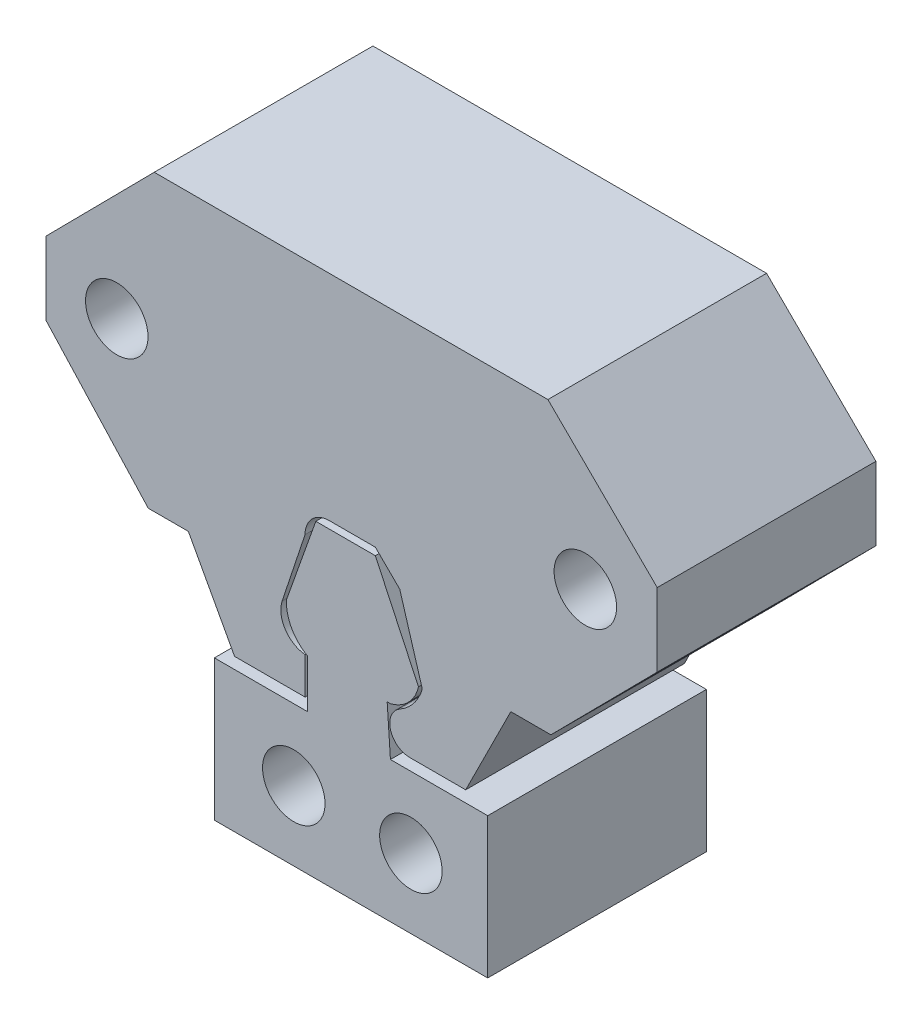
ISO-10303-21;
HEADER;
FILE_DESCRIPTION(('STEP AP214'),'2;1');
FILE_NAME('part.step','',(''),(''),'','','');
FILE_SCHEMA(('AUTOMOTIVE_DESIGN { 1 0 10303 214 1 1 1 1 }'));
ENDSEC;
DATA;
#1=APPLICATION_CONTEXT('core data for automotive mechanical design processes');
#2=APPLICATION_PROTOCOL_DEFINITION('international standard','automotive_design',2000,#1);
#3=PRODUCT_CONTEXT('',#1,'mechanical');
#4=PRODUCT('Part','Part','',(#3));
#5=PRODUCT_RELATED_PRODUCT_CATEGORY('part','',(#4));
#6=PRODUCT_DEFINITION_FORMATION('','',#4);
#7=PRODUCT_DEFINITION_CONTEXT('part definition',#1,'design');
#8=PRODUCT_DEFINITION('design','',#6,#7);
#9=PRODUCT_DEFINITION_SHAPE('','',#8);
#10=(LENGTH_UNIT() NAMED_UNIT(*) SI_UNIT(.MILLI.,.METRE.));
#11=(NAMED_UNIT(*) PLANE_ANGLE_UNIT() SI_UNIT($,.RADIAN.));
#12=(NAMED_UNIT(*) SI_UNIT($,.STERADIAN.) SOLID_ANGLE_UNIT());
#13=UNCERTAINTY_MEASURE_WITH_UNIT(LENGTH_MEASURE(1.E-05),#10,'distance_accuracy_value','');
#14=(GEOMETRIC_REPRESENTATION_CONTEXT(3) GLOBAL_UNCERTAINTY_ASSIGNED_CONTEXT((#13)) GLOBAL_UNIT_ASSIGNED_CONTEXT((#10,
#11,#12)) REPRESENTATION_CONTEXT('',''));
#15=CARTESIAN_POINT('',(0.,0.,0.));
#16=DIRECTION('',(0.,0.,1.));
#17=DIRECTION('',(1.,0.,0.));
#18=AXIS2_PLACEMENT_3D('',#15,#16,#17);
#19=CARTESIAN_POINT('',(155.962614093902,172.348565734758,28.));
#20=DIRECTION('',(0.,0.,1.));
#21=DIRECTION('',(1.,0.,0.));
#22=AXIS2_PLACEMENT_3D('',#19,#20,#21);
#23=PLANE('',#22);
#24=CARTESIAN_POINT('',(131.539430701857,194.135131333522,28.));
#25=DIRECTION('',(0.,0.,1.));
#26=DIRECTION('',(1.,0.,0.));
#27=AXIS2_PLACEMENT_3D('',#24,#25,#26);
#28=CIRCLE('',#27,3.99999999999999);
#29=CARTESIAN_POINT('',(135.539430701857,194.135131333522,28.));
#30=VERTEX_POINT('',#29);
#31=EDGE_CURVE('E250',#30,#30,#28,.T.);
#32=ORIENTED_EDGE('',*,*,#31,.F.);
#33=EDGE_LOOP('',(#32));
#34=FACE_BOUND('',#33,.T.);
#35=DIRECTION('',(1.,0.,0.));
#36=VECTOR('',#35,1.);
#37=CARTESIAN_POINT('',(154.202749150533,164.233861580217,28.));
#38=LINE('',#37,#36);
#39=CARTESIAN_POINT('',(146.627618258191,164.233861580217,28.));
#40=VERTEX_POINT('',#39);
#41=CARTESIAN_POINT('',(155.666645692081,164.233861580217,28.));
#42=VERTEX_POINT('',#41);
#43=EDGE_CURVE('E314',#40,#42,#38,.T.);
#44=ORIENTED_EDGE('',*,*,#43,.T.);
#45=DIRECTION('',(0.,1.,0.));
#46=VECTOR('',#45,1.);
#47=CARTESIAN_POINT('',(155.666645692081,168.944632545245,28.));
#48=LINE('',#47,#46);
#49=CARTESIAN_POINT('',(155.666645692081,168.944632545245,28.));
#50=VERTEX_POINT('',#49);
#51=EDGE_CURVE('E144',#42,#50,#48,.T.);
#52=ORIENTED_EDGE('',*,*,#51,.T.);
#53=CARTESIAN_POINT('',(155.962614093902,172.348565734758,28.));
#54=DIRECTION('',(0.,0.,-1.));
#55=DIRECTION('',(1.,0.,0.));
#56=AXIS2_PLACEMENT_3D('',#53,#54,#55);
#57=CIRCLE('',#56,3.41677603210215);
#58=CARTESIAN_POINT('',(152.719930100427,173.425301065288,28.));
#59=VERTEX_POINT('',#58);
#60=EDGE_CURVE('E309',#50,#59,#57,.T.);
#61=ORIENTED_EDGE('',*,*,#60,.T.);
#62=DIRECTION('',(0.315131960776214,0.949047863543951,0.));
#63=VECTOR('',#62,1.);
#64=CARTESIAN_POINT('',(155.651170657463,182.252992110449,28.));
#65=LINE('',#64,#63);
#66=CARTESIAN_POINT('',(155.651170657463,182.252992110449,28.));
#67=VERTEX_POINT('',#66);
#68=EDGE_CURVE('E232',#59,#67,#65,.T.);
#69=ORIENTED_EDGE('',*,*,#68,.T.);
#70=CARTESIAN_POINT('',(158.754258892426,182.252016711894,28.));
#71=DIRECTION('',(0.,0.,-1.));
#72=DIRECTION('',(1.,0.,0.));
#73=AXIS2_PLACEMENT_3D('',#70,#71,#72);
#74=CIRCLE('',#73,3.1030883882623);
#75=CARTESIAN_POINT('',(158.754258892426,185.355105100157,28.));
#76=VERTEX_POINT('',#75);
#77=EDGE_CURVE('E304',#67,#76,#74,.T.);
#78=ORIENTED_EDGE('',*,*,#77,.T.);
#79=DIRECTION('',(1.,0.,0.));
#80=VECTOR('',#79,1.);
#81=CARTESIAN_POINT('',(164.653484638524,185.355105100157,28.));
#82=LINE('',#81,#80);
#83=CARTESIAN_POINT('',(164.653484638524,185.355105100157,28.));
#84=VERTEX_POINT('',#83);
#85=EDGE_CURVE('E301',#76,#84,#82,.T.);
#86=ORIENTED_EDGE('',*,*,#85,.T.);
#87=DIRECTION('',(0.710916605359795,-0.703276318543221,0.));
#88=VECTOR('',#87,1.);
#89=CARTESIAN_POINT('',(167.771821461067,182.270281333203,28.));
#90=LINE('',#89,#88);
#91=CARTESIAN_POINT('',(167.771821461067,182.270281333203,28.));
#92=VERTEX_POINT('',#91);
#93=EDGE_CURVE('E298',#84,#92,#90,.T.);
#94=ORIENTED_EDGE('',*,*,#93,.T.);
#95=DIRECTION('',(0.287145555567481,-0.957886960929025,0.));
#96=VECTOR('',#95,1.);
#97=CARTESIAN_POINT('',(170.663369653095,172.624384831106,28.));
#98=LINE('',#97,#96);
#99=CARTESIAN_POINT('',(170.663369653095,172.624384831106,28.));
#100=VERTEX_POINT('',#99);
#101=EDGE_CURVE('E295',#92,#100,#98,.T.);
#102=ORIENTED_EDGE('',*,*,#101,.T.);
#103=CARTESIAN_POINT('',(164.670683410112,174.385026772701,28.));
#104=DIRECTION('',(0.,0.,-1.));
#105=DIRECTION('',(1.,0.,0.));
#106=AXIS2_PLACEMENT_3D('',#103,#104,#105);
#107=CIRCLE('',#106,6.24597057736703);
#108=CARTESIAN_POINT('',(167.771821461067,168.963302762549,28.));
#109=VERTEX_POINT('',#108);
#110=EDGE_CURVE('E292',#100,#109,#107,.T.);
#111=ORIENTED_EDGE('',*,*,#110,.T.);
#112=CARTESIAN_POINT('',(169.028852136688,166.765634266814,28.));
#113=DIRECTION('',(0.,0.,1.));
#114=DIRECTION('',(-1.,0.,0.));
#115=AXIS2_PLACEMENT_3D('',#112,#113,#114);
#116=CIRCLE('',#115,2.53177268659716);
#117=CARTESIAN_POINT('',(169.028852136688,164.233861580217,28.));
#118=VERTEX_POINT('',#117);
#119=EDGE_CURVE('E289',#109,#118,#116,.T.);
#120=ORIENTED_EDGE('',*,*,#119,.T.);
#121=DIRECTION('',(1.,0.,0.));
#122=VECTOR('',#121,1.);
#123=CARTESIAN_POINT('',(176.220729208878,164.233861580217,28.));
#124=LINE('',#123,#122);
#125=CARTESIAN_POINT('',(176.220729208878,164.233861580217,28.));
#126=VERTEX_POINT('',#125);
#127=EDGE_CURVE('E286',#118,#126,#124,.T.);
#128=ORIENTED_EDGE('',*,*,#127,.T.);
#129=DIRECTION('',(0.447037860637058,0.894515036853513,0.));
#130=VECTOR('',#129,1.);
#131=CARTESIAN_POINT('',(181.996754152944,175.791587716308,28.));
#132=LINE('',#131,#130);
#133=CARTESIAN_POINT('',(181.996754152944,175.791587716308,28.));
#134=VERTEX_POINT('',#133);
#135=EDGE_CURVE('E283',#126,#134,#132,.T.);
#136=ORIENTED_EDGE('',*,*,#135,.T.);
#137=DIRECTION('',(1.,0.,0.));
#138=VECTOR('',#137,1.);
#139=CARTESIAN_POINT('',(187.130080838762,175.791587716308,28.));
#140=LINE('',#139,#138);
#141=CARTESIAN_POINT('',(187.130080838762,175.791587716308,28.));
#142=VERTEX_POINT('',#141);
#143=EDGE_CURVE('E280',#134,#142,#140,.T.);
#144=ORIENTED_EDGE('',*,*,#143,.T.);
#145=DIRECTION('',(0.703276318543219,0.710916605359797,0.));
#146=VECTOR('',#145,1.);
#147=CARTESIAN_POINT('',(200.746457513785,189.555890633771,28.));
#148=LINE('',#147,#146);
#149=CARTESIAN_POINT('',(200.746457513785,189.555890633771,28.));
#150=VERTEX_POINT('',#149);
#151=EDGE_CURVE('E277',#142,#150,#148,.T.);
#152=ORIENTED_EDGE('',*,*,#151,.T.);
#153=DIRECTION('',(0.,1.,0.));
#154=VECTOR('',#153,1.);
#155=CARTESIAN_POINT('',(200.746457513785,198.927124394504,28.));
#156=LINE('',#155,#154);
#157=CARTESIAN_POINT('',(200.746457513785,198.927124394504,28.));
#158=VERTEX_POINT('',#157);
#159=EDGE_CURVE('E274',#150,#158,#156,.T.);
#160=ORIENTED_EDGE('',*,*,#159,.T.);
#161=DIRECTION('',(-0.710916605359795,0.70327631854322,0.));
#162=VECTOR('',#161,1.);
#163=CARTESIAN_POINT('',(186.746457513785,212.776665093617,28.));
#164=LINE('',#163,#162);
#165=CARTESIAN_POINT('',(186.746457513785,212.776665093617,28.));
#166=VERTEX_POINT('',#165);
#167=EDGE_CURVE('E271',#158,#166,#164,.T.);
#168=ORIENTED_EDGE('',*,*,#167,.T.);
#169=DIRECTION('',(-1.,0.,0.));
#170=VECTOR('',#169,1.);
#171=CARTESIAN_POINT('',(136.340150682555,212.776665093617,28.));
#172=LINE('',#171,#170);
#173=CARTESIAN_POINT('',(136.340150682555,212.776665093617,28.));
#174=VERTEX_POINT('',#173);
#175=EDGE_CURVE('E268',#166,#174,#172,.T.);
#176=ORIENTED_EDGE('',*,*,#175,.T.);
#177=DIRECTION('',(-0.703276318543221,-0.710916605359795,0.));
#178=VECTOR('',#177,1.);
#179=CARTESIAN_POINT('',(136.340150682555,212.776665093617,28.));
#180=LINE('',#179,#178);
#181=CARTESIAN_POINT('',(122.490609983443,198.776665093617,28.));
#182=VERTEX_POINT('',#181);
#183=EDGE_CURVE('E265',#174,#182,#180,.T.);
#184=ORIENTED_EDGE('',*,*,#183,.T.);
#185=DIRECTION('',(0.,-1.,0.));
#186=VECTOR('',#185,1.);
#187=CARTESIAN_POINT('',(122.490609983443,198.776665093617,28.));
#188=LINE('',#187,#186);
#189=CARTESIAN_POINT('',(122.490609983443,189.405431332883,28.));
#190=VERTEX_POINT('',#189);
#191=EDGE_CURVE('E262',#182,#190,#188,.T.);
#192=ORIENTED_EDGE('',*,*,#191,.T.);
#193=DIRECTION('',(0.675837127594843,-0.73705100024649,0.));
#194=VECTOR('',#193,1.);
#195=CARTESIAN_POINT('',(122.490609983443,189.405431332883,28.));
#196=LINE('',#195,#194);
#197=CARTESIAN_POINT('',(135.575726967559,175.135131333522,28.));
#198=VERTEX_POINT('',#197);
#199=EDGE_CURVE('E259',#190,#198,#196,.T.);
#200=ORIENTED_EDGE('',*,*,#199,.T.);
#201=DIRECTION('',(1.,0.,0.));
#202=VECTOR('',#201,1.);
#203=CARTESIAN_POINT('',(135.575726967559,175.135131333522,28.));
#204=LINE('',#203,#202);
#205=CARTESIAN_POINT('',(140.709053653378,175.135131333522,28.));
#206=VERTEX_POINT('',#205);
#207=EDGE_CURVE('E255',#198,#206,#204,.T.);
#208=ORIENTED_EDGE('',*,*,#207,.T.);
#209=DIRECTION('',(0.4771374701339,-0.878828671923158,0.));
#210=VECTOR('',#209,1.);
#211=CARTESIAN_POINT('',(146.627618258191,164.233861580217,28.));
#212=LINE('',#211,#210);
#213=EDGE_CURVE('E251',#206,#40,#212,.T.);
#214=ORIENTED_EDGE('',*,*,#213,.T.);
#215=EDGE_LOOP('',(#44,#52,#61,#69,#78,#86,#94,#102,#111,#120,#128,#136,#144,#152,#160,#168,
#176,#184,#192,#200,#208,#214));
#216=FACE_BOUND('',#215,.T.);
#217=CARTESIAN_POINT('',(191.539430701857,194.135131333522,28.));
#218=DIRECTION('',(0.,0.,1.));
#219=DIRECTION('',(1.,0.,0.));
#220=AXIS2_PLACEMENT_3D('',#217,#218,#219);
#221=CIRCLE('',#220,3.99999999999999);
#222=CARTESIAN_POINT('',(195.539430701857,194.135131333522,28.));
#223=VERTEX_POINT('',#222);
#224=EDGE_CURVE('E59',#223,#223,#221,.T.);
#225=ORIENTED_EDGE('',*,*,#224,.F.);
#226=EDGE_LOOP('',(#225));
#227=FACE_BOUND('',#226,.T.);
#228=ADVANCED_FACE('F55',(#34,#216,#227),#23,.T.);
#229=CARTESIAN_POINT('',(155.962614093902,172.348565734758,0.));
#230=DIRECTION('',(0.,0.,1.));
#231=DIRECTION('',(1.,0.,0.));
#232=AXIS2_PLACEMENT_3D('',#229,#230,#231);
#233=PLANE('',#232);
#234=DIRECTION('',(0.,1.,0.));
#235=VECTOR('',#234,1.);
#236=CARTESIAN_POINT('',(155.666645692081,168.944632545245,0.));
#237=LINE('',#236,#235);
#238=CARTESIAN_POINT('',(155.666645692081,164.233861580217,0.));
#239=VERTEX_POINT('',#238);
#240=CARTESIAN_POINT('',(155.666645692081,168.944632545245,0.));
#241=VERTEX_POINT('',#240);
#242=EDGE_CURVE('E225',#239,#241,#237,.T.);
#243=ORIENTED_EDGE('',*,*,#242,.F.);
#244=DIRECTION('',(1.,0.,0.));
#245=VECTOR('',#244,1.);
#246=CARTESIAN_POINT('',(154.202749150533,164.233861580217,0.));
#247=LINE('',#246,#245);
#248=CARTESIAN_POINT('',(146.627618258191,164.233861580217,0.));
#249=VERTEX_POINT('',#248);
#250=EDGE_CURVE('E73',#249,#239,#247,.T.);
#251=ORIENTED_EDGE('',*,*,#250,.F.);
#252=DIRECTION('',(0.4771374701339,-0.878828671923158,0.));
#253=VECTOR('',#252,1.);
#254=CARTESIAN_POINT('',(146.627618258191,164.233861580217,0.));
#255=LINE('',#254,#253);
#256=CARTESIAN_POINT('',(140.709053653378,175.135131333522,0.));
#257=VERTEX_POINT('',#256);
#258=EDGE_CURVE('E156',#257,#249,#255,.T.);
#259=ORIENTED_EDGE('',*,*,#258,.F.);
#260=DIRECTION('',(1.,0.,0.));
#261=VECTOR('',#260,1.);
#262=CARTESIAN_POINT('',(135.575726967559,175.135131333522,0.));
#263=LINE('',#262,#261);
#264=CARTESIAN_POINT('',(135.575726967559,175.135131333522,0.));
#265=VERTEX_POINT('',#264);
#266=EDGE_CURVE('E638',#265,#257,#263,.T.);
#267=ORIENTED_EDGE('',*,*,#266,.F.);
#268=DIRECTION('',(0.675837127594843,-0.73705100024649,0.));
#269=VECTOR('',#268,1.);
#270=CARTESIAN_POINT('',(122.490609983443,189.405431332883,0.));
#271=LINE('',#270,#269);
#272=CARTESIAN_POINT('',(122.490609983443,189.405431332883,0.));
#273=VERTEX_POINT('',#272);
#274=EDGE_CURVE('E635',#273,#265,#271,.T.);
#275=ORIENTED_EDGE('',*,*,#274,.F.);
#276=DIRECTION('',(0.,-1.,0.));
#277=VECTOR('',#276,1.);
#278=CARTESIAN_POINT('',(122.490609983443,198.776665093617,0.));
#279=LINE('',#278,#277);
#280=CARTESIAN_POINT('',(122.490609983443,198.776665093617,0.));
#281=VERTEX_POINT('',#280);
#282=EDGE_CURVE('E632',#281,#273,#279,.T.);
#283=ORIENTED_EDGE('',*,*,#282,.F.);
#284=DIRECTION('',(-0.703276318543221,-0.710916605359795,0.));
#285=VECTOR('',#284,1.);
#286=CARTESIAN_POINT('',(136.340150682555,212.776665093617,0.));
#287=LINE('',#286,#285);
#288=CARTESIAN_POINT('',(136.340150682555,212.776665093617,0.));
#289=VERTEX_POINT('',#288);
#290=EDGE_CURVE('E629',#289,#281,#287,.T.);
#291=ORIENTED_EDGE('',*,*,#290,.F.);
#292=DIRECTION('',(-1.,0.,0.));
#293=VECTOR('',#292,1.);
#294=CARTESIAN_POINT('',(136.340150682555,212.776665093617,0.));
#295=LINE('',#294,#293);
#296=CARTESIAN_POINT('',(186.746457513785,212.776665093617,0.));
#297=VERTEX_POINT('',#296);
#298=EDGE_CURVE('E626',#297,#289,#295,.T.);
#299=ORIENTED_EDGE('',*,*,#298,.F.);
#300=DIRECTION('',(-0.710916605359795,0.70327631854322,0.));
#301=VECTOR('',#300,1.);
#302=CARTESIAN_POINT('',(186.746457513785,212.776665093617,0.));
#303=LINE('',#302,#301);
#304=CARTESIAN_POINT('',(200.746457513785,198.927124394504,0.));
#305=VERTEX_POINT('',#304);
#306=EDGE_CURVE('E623',#305,#297,#303,.T.);
#307=ORIENTED_EDGE('',*,*,#306,.F.);
#308=DIRECTION('',(0.,1.,0.));
#309=VECTOR('',#308,1.);
#310=CARTESIAN_POINT('',(200.746457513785,198.927124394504,0.));
#311=LINE('',#310,#309);
#312=CARTESIAN_POINT('',(200.746457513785,189.555890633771,0.));
#313=VERTEX_POINT('',#312);
#314=EDGE_CURVE('E620',#313,#305,#311,.T.);
#315=ORIENTED_EDGE('',*,*,#314,.F.);
#316=DIRECTION('',(0.703276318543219,0.710916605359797,0.));
#317=VECTOR('',#316,1.);
#318=CARTESIAN_POINT('',(200.746457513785,189.555890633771,0.));
#319=LINE('',#318,#317);
#320=CARTESIAN_POINT('',(187.130080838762,175.791587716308,0.));
#321=VERTEX_POINT('',#320);
#322=EDGE_CURVE('E617',#321,#313,#319,.T.);
#323=ORIENTED_EDGE('',*,*,#322,.F.);
#324=DIRECTION('',(1.,0.,0.));
#325=VECTOR('',#324,1.);
#326=CARTESIAN_POINT('',(187.130080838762,175.791587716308,0.));
#327=LINE('',#326,#325);
#328=CARTESIAN_POINT('',(181.996754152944,175.791587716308,0.));
#329=VERTEX_POINT('',#328);
#330=EDGE_CURVE('E614',#329,#321,#327,.T.);
#331=ORIENTED_EDGE('',*,*,#330,.F.);
#332=DIRECTION('',(0.447037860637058,0.894515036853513,0.));
#333=VECTOR('',#332,1.);
#334=CARTESIAN_POINT('',(181.996754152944,175.791587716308,0.));
#335=LINE('',#334,#333);
#336=CARTESIAN_POINT('',(176.220729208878,164.233861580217,0.));
#337=VERTEX_POINT('',#336);
#338=EDGE_CURVE('E611',#337,#329,#335,.T.);
#339=ORIENTED_EDGE('',*,*,#338,.F.);
#340=DIRECTION('',(1.,0.,0.));
#341=VECTOR('',#340,1.);
#342=CARTESIAN_POINT('',(176.220729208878,164.233861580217,0.));
#343=LINE('',#342,#341);
#344=CARTESIAN_POINT('',(169.028852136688,164.233861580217,0.));
#345=VERTEX_POINT('',#344);
#346=EDGE_CURVE('E608',#345,#337,#343,.T.);
#347=ORIENTED_EDGE('',*,*,#346,.F.);
#348=CARTESIAN_POINT('',(169.028852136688,166.765634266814,0.));
#349=DIRECTION('',(0.,0.,1.));
#350=DIRECTION('',(-1.,0.,0.));
#351=AXIS2_PLACEMENT_3D('',#348,#349,#350);
#352=CIRCLE('',#351,2.53177268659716);
#353=CARTESIAN_POINT('',(167.771821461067,168.963302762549,0.));
#354=VERTEX_POINT('',#353);
#355=EDGE_CURVE('E605',#354,#345,#352,.T.);
#356=ORIENTED_EDGE('',*,*,#355,.F.);
#357=CARTESIAN_POINT('',(164.670683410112,174.385026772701,0.));
#358=DIRECTION('',(0.,0.,-1.));
#359=DIRECTION('',(1.,0.,0.));
#360=AXIS2_PLACEMENT_3D('',#357,#358,#359);
#361=CIRCLE('',#360,6.24597057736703);
#362=CARTESIAN_POINT('',(170.663369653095,172.624384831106,0.));
#363=VERTEX_POINT('',#362);
#364=EDGE_CURVE('E602',#363,#354,#361,.T.);
#365=ORIENTED_EDGE('',*,*,#364,.F.);
#366=DIRECTION('',(0.287145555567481,-0.957886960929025,0.));
#367=VECTOR('',#366,1.);
#368=CARTESIAN_POINT('',(170.663369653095,172.624384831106,0.));
#369=LINE('',#368,#367);
#370=CARTESIAN_POINT('',(167.771821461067,182.270281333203,0.));
#371=VERTEX_POINT('',#370);
#372=EDGE_CURVE('E597',#371,#363,#369,.T.);
#373=ORIENTED_EDGE('',*,*,#372,.F.);
#374=DIRECTION('',(0.710916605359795,-0.703276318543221,0.));
#375=VECTOR('',#374,1.);
#376=CARTESIAN_POINT('',(167.771821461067,182.270281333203,0.));
#377=LINE('',#376,#375);
#378=CARTESIAN_POINT('',(164.653484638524,185.355105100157,0.));
#379=VERTEX_POINT('',#378);
#380=EDGE_CURVE('E594',#379,#371,#377,.T.);
#381=ORIENTED_EDGE('',*,*,#380,.F.);
#382=DIRECTION('',(1.,0.,0.));
#383=VECTOR('',#382,1.);
#384=CARTESIAN_POINT('',(164.653484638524,185.355105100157,0.));
#385=LINE('',#384,#383);
#386=CARTESIAN_POINT('',(158.754258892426,185.355105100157,0.));
#387=VERTEX_POINT('',#386);
#388=EDGE_CURVE('E244',#387,#379,#385,.T.);
#389=ORIENTED_EDGE('',*,*,#388,.F.);
#390=CARTESIAN_POINT('',(158.754258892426,182.252016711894,0.));
#391=DIRECTION('',(0.,0.,-1.));
#392=DIRECTION('',(1.,0.,0.));
#393=AXIS2_PLACEMENT_3D('',#390,#391,#392);
#394=CIRCLE('',#393,3.1030883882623);
#395=CARTESIAN_POINT('',(155.651170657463,182.252992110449,0.));
#396=VERTEX_POINT('',#395);
#397=EDGE_CURVE('E240',#396,#387,#394,.T.);
#398=ORIENTED_EDGE('',*,*,#397,.F.);
#399=DIRECTION('',(0.315131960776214,0.949047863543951,0.));
#400=VECTOR('',#399,1.);
#401=CARTESIAN_POINT('',(155.651170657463,182.252992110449,0.));
#402=LINE('',#401,#400);
#403=CARTESIAN_POINT('',(152.719930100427,173.425301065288,0.));
#404=VERTEX_POINT('',#403);
#405=EDGE_CURVE('E226',#404,#396,#402,.T.);
#406=ORIENTED_EDGE('',*,*,#405,.F.);
#407=CARTESIAN_POINT('',(155.962614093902,172.348565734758,0.));
#408=DIRECTION('',(0.,0.,-1.));
#409=DIRECTION('',(1.,0.,0.));
#410=AXIS2_PLACEMENT_3D('',#407,#408,#409);
#411=CIRCLE('',#410,3.41677603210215);
#412=EDGE_CURVE('E215',#241,#404,#411,.T.);
#413=ORIENTED_EDGE('',*,*,#412,.F.);
#414=EDGE_LOOP('',(#243,#251,#259,#267,#275,#283,#291,#299,#307,#315,#323,#331,#339,#347,#356,
#365,#373,#381,#389,#398,#406,#413));
#415=FACE_BOUND('',#414,.T.);
#416=CARTESIAN_POINT('',(131.539430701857,194.135131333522,0.));
#417=DIRECTION('',(0.,0.,1.));
#418=DIRECTION('',(1.,0.,0.));
#419=AXIS2_PLACEMENT_3D('',#416,#417,#418);
#420=CIRCLE('',#419,3.99999999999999);
#421=CARTESIAN_POINT('',(135.539430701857,194.135131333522,0.));
#422=VERTEX_POINT('',#421);
#423=EDGE_CURVE('E317',#422,#422,#420,.T.);
#424=ORIENTED_EDGE('',*,*,#423,.T.);
#425=EDGE_LOOP('',(#424));
#426=FACE_BOUND('',#425,.T.);
#427=CARTESIAN_POINT('',(191.539430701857,194.135131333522,0.));
#428=DIRECTION('',(0.,0.,1.));
#429=DIRECTION('',(1.,0.,0.));
#430=AXIS2_PLACEMENT_3D('',#427,#428,#429);
#431=CIRCLE('',#430,3.99999999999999);
#432=CARTESIAN_POINT('',(195.539430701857,194.135131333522,0.));
#433=VERTEX_POINT('',#432);
#434=EDGE_CURVE('E12',#433,#433,#431,.T.);
#435=ORIENTED_EDGE('',*,*,#434,.T.);
#436=EDGE_LOOP('',(#435));
#437=FACE_BOUND('',#436,.T.);
#438=ADVANCED_FACE('F237',(#415,#426,#437),#233,.F.);
#439=CARTESIAN_POINT('',(155.666645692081,168.944632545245,28.));
#440=DIRECTION('',(-1.,0.,0.));
#441=DIRECTION('',(0.,0.,1.));
#442=AXIS2_PLACEMENT_3D('',#439,#440,#441);
#443=PLANE('',#442);
#444=ORIENTED_EDGE('',*,*,#242,.T.);
#445=DIRECTION('',(0.,0.,-1.));
#446=VECTOR('',#445,1.);
#447=CARTESIAN_POINT('',(155.666645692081,168.944632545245,28.));
#448=LINE('',#447,#446);
#449=EDGE_CURVE('E221',#50,#241,#448,.T.);
#450=ORIENTED_EDGE('',*,*,#449,.F.);
#451=ORIENTED_EDGE('',*,*,#51,.F.);
#452=DIRECTION('',(0.,0.,-1.));
#453=VECTOR('',#452,1.);
#454=CARTESIAN_POINT('',(155.666645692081,164.233861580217,28.));
#455=LINE('',#454,#453);
#456=EDGE_CURVE('E712',#42,#239,#455,.T.);
#457=ORIENTED_EDGE('',*,*,#456,.T.);
#458=EDGE_LOOP('',(#444,#450,#451,#457));
#459=FACE_BOUND('',#458,.T.);
#460=ADVANCED_FACE('F340',(#459),#443,.F.);
#461=CARTESIAN_POINT('',(155.962614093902,172.348565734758,28.));
#462=DIRECTION('',(0.,0.,-1.));
#463=DIRECTION('',(-1.,0.,0.));
#464=AXIS2_PLACEMENT_3D('',#461,#462,#463);
#465=CYLINDRICAL_SURFACE('',#464,3.41677603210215);
#466=ORIENTED_EDGE('',*,*,#412,.T.);
#467=DIRECTION('',(0.,0.,-1.));
#468=VECTOR('',#467,1.);
#469=CARTESIAN_POINT('',(152.719930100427,173.425301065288,28.));
#470=LINE('',#469,#468);
#471=EDGE_CURVE('E219',#59,#404,#470,.T.);
#472=ORIENTED_EDGE('',*,*,#471,.F.);
#473=ORIENTED_EDGE('',*,*,#60,.F.);
#474=ORIENTED_EDGE('',*,*,#449,.T.);
#475=EDGE_LOOP('',(#466,#472,#473,#474));
#476=FACE_BOUND('',#475,.T.);
#477=ADVANCED_FACE('F217',(#476),#465,.F.);
#478=CARTESIAN_POINT('',(155.651170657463,182.252992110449,28.));
#479=DIRECTION('',(-0.949047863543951,0.315131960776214,0.));
#480=DIRECTION('',(-0.315131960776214,-0.949047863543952,0.));
#481=AXIS2_PLACEMENT_3D('',#478,#479,#480);
#482=PLANE('',#481);
#483=ORIENTED_EDGE('',*,*,#405,.T.);
#484=DIRECTION('',(0.,0.,-1.));
#485=VECTOR('',#484,1.);
#486=CARTESIAN_POINT('',(155.651170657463,182.252992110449,28.));
#487=LINE('',#486,#485);
#488=EDGE_CURVE('E234',#67,#396,#487,.T.);
#489=ORIENTED_EDGE('',*,*,#488,.F.);
#490=ORIENTED_EDGE('',*,*,#68,.F.);
#491=ORIENTED_EDGE('',*,*,#471,.T.);
#492=EDGE_LOOP('',(#483,#489,#490,#491));
#493=FACE_BOUND('',#492,.T.);
#494=ADVANCED_FACE('F229',(#493),#482,.F.);
#495=CARTESIAN_POINT('',(158.754258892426,182.252016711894,28.));
#496=DIRECTION('',(0.,0.,-1.));
#497=DIRECTION('',(-1.,0.,0.));
#498=AXIS2_PLACEMENT_3D('',#495,#496,#497);
#499=CYLINDRICAL_SURFACE('',#498,3.1030883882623);
#500=ORIENTED_EDGE('',*,*,#397,.T.);
#501=DIRECTION('',(0.,0.,-1.));
#502=VECTOR('',#501,1.);
#503=CARTESIAN_POINT('',(158.754258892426,185.355105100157,28.));
#504=LINE('',#503,#502);
#505=EDGE_CURVE('E585',#76,#387,#504,.T.);
#506=ORIENTED_EDGE('',*,*,#505,.F.);
#507=ORIENTED_EDGE('',*,*,#77,.F.);
#508=ORIENTED_EDGE('',*,*,#488,.T.);
#509=EDGE_LOOP('',(#500,#506,#507,#508));
#510=FACE_BOUND('',#509,.T.);
#511=ADVANCED_FACE('F423',(#510),#499,.F.);
#512=CARTESIAN_POINT('',(164.653484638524,185.355105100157,28.));
#513=DIRECTION('',(0.,1.,0.));
#514=DIRECTION('',(0.,0.,1.));
#515=AXIS2_PLACEMENT_3D('',#512,#513,#514);
#516=PLANE('',#515);
#517=ORIENTED_EDGE('',*,*,#388,.T.);
#518=DIRECTION('',(0.,0.,-1.));
#519=VECTOR('',#518,1.);
#520=CARTESIAN_POINT('',(164.653484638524,185.355105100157,28.));
#521=LINE('',#520,#519);
#522=EDGE_CURVE('E590',#84,#379,#521,.T.);
#523=ORIENTED_EDGE('',*,*,#522,.F.);
#524=ORIENTED_EDGE('',*,*,#85,.F.);
#525=ORIENTED_EDGE('',*,*,#505,.T.);
#526=EDGE_LOOP('',(#517,#523,#524,#525));
#527=FACE_BOUND('',#526,.T.);
#528=ADVANCED_FACE('F419',(#527),#516,.F.);
#529=CARTESIAN_POINT('',(167.771821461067,182.270281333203,28.));
#530=DIRECTION('',(0.703276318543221,0.710916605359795,0.));
#531=DIRECTION('',(-0.710916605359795,0.703276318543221,0.));
#532=AXIS2_PLACEMENT_3D('',#529,#530,#531);
#533=PLANE('',#532);
#534=ORIENTED_EDGE('',*,*,#380,.T.);
#535=DIRECTION('',(0.,0.,-1.));
#536=VECTOR('',#535,1.);
#537=CARTESIAN_POINT('',(167.771821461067,182.270281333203,28.));
#538=LINE('',#537,#536);
#539=EDGE_CURVE('E702',#92,#371,#538,.T.);
#540=ORIENTED_EDGE('',*,*,#539,.F.);
#541=ORIENTED_EDGE('',*,*,#93,.F.);
#542=ORIENTED_EDGE('',*,*,#522,.T.);
#543=EDGE_LOOP('',(#534,#540,#541,#542));
#544=FACE_BOUND('',#543,.T.);
#545=ADVANCED_FACE('F415',(#544),#533,.F.);
#546=CARTESIAN_POINT('',(170.663369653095,172.624384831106,28.));
#547=DIRECTION('',(0.957886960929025,0.287145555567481,0.));
#548=DIRECTION('',(-0.287145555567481,0.957886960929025,0.));
#549=AXIS2_PLACEMENT_3D('',#546,#547,#548);
#550=PLANE('',#549);
#551=ORIENTED_EDGE('',*,*,#372,.T.);
#552=DIRECTION('',(0.,0.,-1.));
#553=VECTOR('',#552,1.);
#554=CARTESIAN_POINT('',(170.663369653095,172.624384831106,28.));
#555=LINE('',#554,#553);
#556=EDGE_CURVE('E698',#100,#363,#555,.T.);
#557=ORIENTED_EDGE('',*,*,#556,.F.);
#558=ORIENTED_EDGE('',*,*,#101,.F.);
#559=ORIENTED_EDGE('',*,*,#539,.T.);
#560=EDGE_LOOP('',(#551,#557,#558,#559));
#561=FACE_BOUND('',#560,.T.);
#562=ADVANCED_FACE('F411',(#561),#550,.F.);
#563=CARTESIAN_POINT('',(164.670683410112,174.385026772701,28.));
#564=DIRECTION('',(0.,0.,-1.));
#565=DIRECTION('',(-1.,0.,0.));
#566=AXIS2_PLACEMENT_3D('',#563,#564,#565);
#567=CYLINDRICAL_SURFACE('',#566,6.24597057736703);
#568=ORIENTED_EDGE('',*,*,#364,.T.);
#569=DIRECTION('',(0.,0.,-1.));
#570=VECTOR('',#569,1.);
#571=CARTESIAN_POINT('',(167.771821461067,168.963302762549,28.));
#572=LINE('',#571,#570);
#573=EDGE_CURVE('E694',#109,#354,#572,.T.);
#574=ORIENTED_EDGE('',*,*,#573,.F.);
#575=ORIENTED_EDGE('',*,*,#110,.F.);
#576=ORIENTED_EDGE('',*,*,#556,.T.);
#577=EDGE_LOOP('',(#568,#574,#575,#576));
#578=FACE_BOUND('',#577,.T.);
#579=ADVANCED_FACE('F407',(#578),#567,.F.);
#580=CARTESIAN_POINT('',(169.028852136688,166.765634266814,28.));
#581=DIRECTION('',(0.,0.,-1.));
#582=DIRECTION('',(-1.,0.,0.));
#583=AXIS2_PLACEMENT_3D('',#580,#581,#582);
#584=CYLINDRICAL_SURFACE('',#583,2.53177268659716);
#585=ORIENTED_EDGE('',*,*,#355,.T.);
#586=DIRECTION('',(0.,0.,-1.));
#587=VECTOR('',#586,1.);
#588=CARTESIAN_POINT('',(169.028852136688,164.233861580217,28.));
#589=LINE('',#588,#587);
#590=EDGE_CURVE('E690',#118,#345,#589,.T.);
#591=ORIENTED_EDGE('',*,*,#590,.F.);
#592=ORIENTED_EDGE('',*,*,#119,.F.);
#593=ORIENTED_EDGE('',*,*,#573,.T.);
#594=EDGE_LOOP('',(#585,#591,#592,#593));
#595=FACE_BOUND('',#594,.T.);
#596=ADVANCED_FACE('F403',(#595),#584,.T.);
#597=CARTESIAN_POINT('',(176.220729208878,164.233861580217,28.));
#598=DIRECTION('',(0.,1.,0.));
#599=DIRECTION('',(0.,0.,1.));
#600=AXIS2_PLACEMENT_3D('',#597,#598,#599);
#601=PLANE('',#600);
#602=ORIENTED_EDGE('',*,*,#346,.T.);
#603=DIRECTION('',(0.,0.,-1.));
#604=VECTOR('',#603,1.);
#605=CARTESIAN_POINT('',(176.220729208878,164.233861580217,28.));
#606=LINE('',#605,#604);
#607=EDGE_CURVE('E686',#126,#337,#606,.T.);
#608=ORIENTED_EDGE('',*,*,#607,.F.);
#609=ORIENTED_EDGE('',*,*,#127,.F.);
#610=ORIENTED_EDGE('',*,*,#590,.T.);
#611=EDGE_LOOP('',(#602,#608,#609,#610));
#612=FACE_BOUND('',#611,.T.);
#613=ADVANCED_FACE('F399',(#612),#601,.F.);
#614=CARTESIAN_POINT('',(181.996754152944,175.791587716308,28.));
#615=DIRECTION('',(-0.894515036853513,0.447037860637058,0.));
#616=DIRECTION('',(-0.447037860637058,-0.894515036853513,0.));
#617=AXIS2_PLACEMENT_3D('',#614,#615,#616);
#618=PLANE('',#617);
#619=ORIENTED_EDGE('',*,*,#338,.T.);
#620=DIRECTION('',(0.,0.,-1.));
#621=VECTOR('',#620,1.);
#622=CARTESIAN_POINT('',(181.996754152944,175.791587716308,28.));
#623=LINE('',#622,#621);
#624=EDGE_CURVE('E682',#134,#329,#623,.T.);
#625=ORIENTED_EDGE('',*,*,#624,.F.);
#626=ORIENTED_EDGE('',*,*,#135,.F.);
#627=ORIENTED_EDGE('',*,*,#607,.T.);
#628=EDGE_LOOP('',(#619,#625,#626,#627));
#629=FACE_BOUND('',#628,.T.);
#630=ADVANCED_FACE('F395',(#629),#618,.F.);
#631=CARTESIAN_POINT('',(187.130080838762,175.791587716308,28.));
#632=DIRECTION('',(0.,1.,0.));
#633=DIRECTION('',(0.,0.,1.));
#634=AXIS2_PLACEMENT_3D('',#631,#632,#633);
#635=PLANE('',#634);
#636=ORIENTED_EDGE('',*,*,#330,.T.);
#637=DIRECTION('',(0.,0.,-1.));
#638=VECTOR('',#637,1.);
#639=CARTESIAN_POINT('',(187.130080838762,175.791587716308,28.));
#640=LINE('',#639,#638);
#641=EDGE_CURVE('E678',#142,#321,#640,.T.);
#642=ORIENTED_EDGE('',*,*,#641,.F.);
#643=ORIENTED_EDGE('',*,*,#143,.F.);
#644=ORIENTED_EDGE('',*,*,#624,.T.);
#645=EDGE_LOOP('',(#636,#642,#643,#644));
#646=FACE_BOUND('',#645,.T.);
#647=ADVANCED_FACE('F391',(#646),#635,.F.);
#648=CARTESIAN_POINT('',(200.746457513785,189.555890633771,28.));
#649=DIRECTION('',(-0.710916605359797,0.703276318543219,0.));
#650=DIRECTION('',(-0.703276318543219,-0.710916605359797,0.));
#651=AXIS2_PLACEMENT_3D('',#648,#649,#650);
#652=PLANE('',#651);
#653=ORIENTED_EDGE('',*,*,#322,.T.);
#654=DIRECTION('',(0.,0.,-1.));
#655=VECTOR('',#654,1.);
#656=CARTESIAN_POINT('',(200.746457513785,189.555890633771,28.));
#657=LINE('',#656,#655);
#658=EDGE_CURVE('E674',#150,#313,#657,.T.);
#659=ORIENTED_EDGE('',*,*,#658,.F.);
#660=ORIENTED_EDGE('',*,*,#151,.F.);
#661=ORIENTED_EDGE('',*,*,#641,.T.);
#662=EDGE_LOOP('',(#653,#659,#660,#661));
#663=FACE_BOUND('',#662,.T.);
#664=ADVANCED_FACE('F387',(#663),#652,.F.);
#665=CARTESIAN_POINT('',(200.746457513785,198.927124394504,28.));
#666=DIRECTION('',(-1.,0.,0.));
#667=DIRECTION('',(0.,0.,1.));
#668=AXIS2_PLACEMENT_3D('',#665,#666,#667);
#669=PLANE('',#668);
#670=ORIENTED_EDGE('',*,*,#314,.T.);
#671=DIRECTION('',(0.,0.,-1.));
#672=VECTOR('',#671,1.);
#673=CARTESIAN_POINT('',(200.746457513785,198.927124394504,28.));
#674=LINE('',#673,#672);
#675=EDGE_CURVE('E670',#158,#305,#674,.T.);
#676=ORIENTED_EDGE('',*,*,#675,.F.);
#677=ORIENTED_EDGE('',*,*,#159,.F.);
#678=ORIENTED_EDGE('',*,*,#658,.T.);
#679=EDGE_LOOP('',(#670,#676,#677,#678));
#680=FACE_BOUND('',#679,.T.);
#681=ADVANCED_FACE('F383',(#680),#669,.F.);
#682=CARTESIAN_POINT('',(186.746457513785,212.776665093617,28.));
#683=DIRECTION('',(-0.70327631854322,-0.710916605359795,0.));
#684=DIRECTION('',(0.710916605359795,-0.70327631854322,0.));
#685=AXIS2_PLACEMENT_3D('',#682,#683,#684);
#686=PLANE('',#685);
#687=ORIENTED_EDGE('',*,*,#306,.T.);
#688=DIRECTION('',(0.,0.,-1.));
#689=VECTOR('',#688,1.);
#690=CARTESIAN_POINT('',(186.746457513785,212.776665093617,28.));
#691=LINE('',#690,#689);
#692=EDGE_CURVE('E666',#166,#297,#691,.T.);
#693=ORIENTED_EDGE('',*,*,#692,.F.);
#694=ORIENTED_EDGE('',*,*,#167,.F.);
#695=ORIENTED_EDGE('',*,*,#675,.T.);
#696=EDGE_LOOP('',(#687,#693,#694,#695));
#697=FACE_BOUND('',#696,.T.);
#698=ADVANCED_FACE('F379',(#697),#686,.F.);
#699=CARTESIAN_POINT('',(136.340150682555,212.776665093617,28.));
#700=DIRECTION('',(0.,-1.,0.));
#701=DIRECTION('',(0.,0.,-1.));
#702=AXIS2_PLACEMENT_3D('',#699,#700,#701);
#703=PLANE('',#702);
#704=ORIENTED_EDGE('',*,*,#298,.T.);
#705=DIRECTION('',(0.,0.,-1.));
#706=VECTOR('',#705,1.);
#707=CARTESIAN_POINT('',(136.340150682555,212.776665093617,28.));
#708=LINE('',#707,#706);
#709=EDGE_CURVE('E662',#174,#289,#708,.T.);
#710=ORIENTED_EDGE('',*,*,#709,.F.);
#711=ORIENTED_EDGE('',*,*,#175,.F.);
#712=ORIENTED_EDGE('',*,*,#692,.T.);
#713=EDGE_LOOP('',(#704,#710,#711,#712));
#714=FACE_BOUND('',#713,.T.);
#715=ADVANCED_FACE('F375',(#714),#703,.F.);
#716=CARTESIAN_POINT('',(136.340150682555,212.776665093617,28.));
#717=DIRECTION('',(0.710916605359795,-0.703276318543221,0.));
#718=DIRECTION('',(0.703276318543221,0.710916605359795,0.));
#719=AXIS2_PLACEMENT_3D('',#716,#717,#718);
#720=PLANE('',#719);
#721=ORIENTED_EDGE('',*,*,#290,.T.);
#722=DIRECTION('',(0.,0.,-1.));
#723=VECTOR('',#722,1.);
#724=CARTESIAN_POINT('',(122.490609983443,198.776665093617,28.));
#725=LINE('',#724,#723);
#726=EDGE_CURVE('E658',#182,#281,#725,.T.);
#727=ORIENTED_EDGE('',*,*,#726,.F.);
#728=ORIENTED_EDGE('',*,*,#183,.F.);
#729=ORIENTED_EDGE('',*,*,#709,.T.);
#730=EDGE_LOOP('',(#721,#727,#728,#729));
#731=FACE_BOUND('',#730,.T.);
#732=ADVANCED_FACE('F371',(#731),#720,.F.);
#733=CARTESIAN_POINT('',(122.490609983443,198.776665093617,28.));
#734=DIRECTION('',(1.,0.,0.));
#735=DIRECTION('',(0.,0.,-1.));
#736=AXIS2_PLACEMENT_3D('',#733,#734,#735);
#737=PLANE('',#736);
#738=ORIENTED_EDGE('',*,*,#282,.T.);
#739=DIRECTION('',(0.,0.,-1.));
#740=VECTOR('',#739,1.);
#741=CARTESIAN_POINT('',(122.490609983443,189.405431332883,28.));
#742=LINE('',#741,#740);
#743=EDGE_CURVE('E654',#190,#273,#742,.T.);
#744=ORIENTED_EDGE('',*,*,#743,.F.);
#745=ORIENTED_EDGE('',*,*,#191,.F.);
#746=ORIENTED_EDGE('',*,*,#726,.T.);
#747=EDGE_LOOP('',(#738,#744,#745,#746));
#748=FACE_BOUND('',#747,.T.);
#749=ADVANCED_FACE('F367',(#748),#737,.F.);
#750=CARTESIAN_POINT('',(122.490609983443,189.405431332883,28.));
#751=DIRECTION('',(0.73705100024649,0.675837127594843,0.));
#752=DIRECTION('',(-0.675837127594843,0.73705100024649,0.));
#753=AXIS2_PLACEMENT_3D('',#750,#751,#752);
#754=PLANE('',#753);
#755=ORIENTED_EDGE('',*,*,#274,.T.);
#756=DIRECTION('',(0.,0.,-1.));
#757=VECTOR('',#756,1.);
#758=CARTESIAN_POINT('',(135.575726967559,175.135131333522,28.));
#759=LINE('',#758,#757);
#760=EDGE_CURVE('E650',#198,#265,#759,.T.);
#761=ORIENTED_EDGE('',*,*,#760,.F.);
#762=ORIENTED_EDGE('',*,*,#199,.F.);
#763=ORIENTED_EDGE('',*,*,#743,.T.);
#764=EDGE_LOOP('',(#755,#761,#762,#763));
#765=FACE_BOUND('',#764,.T.);
#766=ADVANCED_FACE('F361',(#765),#754,.F.);
#767=CARTESIAN_POINT('',(135.575726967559,175.135131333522,28.));
#768=DIRECTION('',(0.,1.,0.));
#769=DIRECTION('',(0.,0.,1.));
#770=AXIS2_PLACEMENT_3D('',#767,#768,#769);
#771=PLANE('',#770);
#772=ORIENTED_EDGE('',*,*,#266,.T.);
#773=DIRECTION('',(0.,0.,-1.));
#774=VECTOR('',#773,1.);
#775=CARTESIAN_POINT('',(140.709053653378,175.135131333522,28.));
#776=LINE('',#775,#774);
#777=EDGE_CURVE('E647',#206,#257,#776,.T.);
#778=ORIENTED_EDGE('',*,*,#777,.F.);
#779=ORIENTED_EDGE('',*,*,#207,.F.);
#780=ORIENTED_EDGE('',*,*,#760,.T.);
#781=EDGE_LOOP('',(#772,#778,#779,#780));
#782=FACE_BOUND('',#781,.T.);
#783=ADVANCED_FACE('F357',(#782),#771,.F.);
#784=CARTESIAN_POINT('',(146.627618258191,164.233861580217,28.));
#785=DIRECTION('',(0.878828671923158,0.4771374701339,0.));
#786=DIRECTION('',(-0.4771374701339,0.878828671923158,0.));
#787=AXIS2_PLACEMENT_3D('',#784,#785,#786);
#788=PLANE('',#787);
#789=ORIENTED_EDGE('',*,*,#258,.T.);
#790=DIRECTION('',(0.,0.,-1.));
#791=VECTOR('',#790,1.);
#792=CARTESIAN_POINT('',(146.627618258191,164.233861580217,28.));
#793=LINE('',#792,#791);
#794=EDGE_CURVE('E256',#40,#249,#793,.T.);
#795=ORIENTED_EDGE('',*,*,#794,.F.);
#796=ORIENTED_EDGE('',*,*,#213,.F.);
#797=ORIENTED_EDGE('',*,*,#777,.T.);
#798=EDGE_LOOP('',(#789,#795,#796,#797));
#799=FACE_BOUND('',#798,.T.);
#800=ADVANCED_FACE('F353',(#799),#788,.F.);
#801=CARTESIAN_POINT('',(154.202749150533,164.233861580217,28.));
#802=DIRECTION('',(0.,1.,0.));
#803=DIRECTION('',(0.,0.,1.));
#804=AXIS2_PLACEMENT_3D('',#801,#802,#803);
#805=PLANE('',#804);
#806=ORIENTED_EDGE('',*,*,#250,.T.);
#807=ORIENTED_EDGE('',*,*,#456,.F.);
#808=ORIENTED_EDGE('',*,*,#43,.F.);
#809=ORIENTED_EDGE('',*,*,#794,.T.);
#810=EDGE_LOOP('',(#806,#807,#808,#809));
#811=FACE_BOUND('',#810,.T.);
#812=ADVANCED_FACE('F347',(#811),#805,.F.);
#813=CARTESIAN_POINT('',(131.539430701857,194.135131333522,28.));
#814=DIRECTION('',(0.,0.,-1.));
#815=DIRECTION('',(-1.,0.,0.));
#816=AXIS2_PLACEMENT_3D('',#813,#814,#815);
#817=CYLINDRICAL_SURFACE('',#816,3.99999999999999);
#818=ORIENTED_EDGE('',*,*,#31,.T.);
#819=EDGE_LOOP('',(#818));
#820=FACE_BOUND('',#819,.T.);
#821=ORIENTED_EDGE('',*,*,#423,.F.);
#822=EDGE_LOOP('',(#821));
#823=FACE_BOUND('',#822,.T.);
#824=ADVANCED_FACE('F325',(#820,#823),#817,.F.);
#825=CARTESIAN_POINT('',(191.539430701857,194.135131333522,28.));
#826=DIRECTION('',(0.,0.,-1.));
#827=DIRECTION('',(-1.,0.,0.));
#828=AXIS2_PLACEMENT_3D('',#825,#826,#827);
#829=CYLINDRICAL_SURFACE('',#828,3.99999999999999);
#830=ORIENTED_EDGE('',*,*,#224,.T.);
#831=EDGE_LOOP('',(#830));
#832=FACE_BOUND('',#831,.T.);
#833=ORIENTED_EDGE('',*,*,#434,.F.);
#834=EDGE_LOOP('',(#833));
#835=FACE_BOUND('',#834,.T.);
#836=ADVANCED_FACE('F57',(#832,#835),#829,.F.);
#837=CLOSED_SHELL('',(#228,#438,#460,#477,#494,#511,#528,#545,#562,#579,#596,#613,#630,#647,
#664,#681,#698,#715,#732,#749,#766,#783,#800,#812,#824,#836));
#838=MANIFOLD_SOLID_BREP('B2',#837);
#839=CARTESIAN_POINT('',(158.615069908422,173.597816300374,28.));
#840=DIRECTION('',(0.,0.,-1.));
#841=DIRECTION('',(-1.,0.,0.));
#842=AXIS2_PLACEMENT_3D('',#839,#840,#841);
#843=PLANE('',#842);
#844=CARTESIAN_POINT('',(158.615069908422,173.597816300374,28.));
#845=DIRECTION('',(0.,0.,1.));
#846=DIRECTION('',(-1.,0.,0.));
#847=AXIS2_PLACEMENT_3D('',#844,#845,#846);
#848=CIRCLE('',#847,5.35608447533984);
#849=CARTESIAN_POINT('',(153.263512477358,173.817984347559,28.));
#850=VERTEX_POINT('',#849);
#851=CARTESIAN_POINT('',(155.962614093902,168.944632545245,28.));
#852=VERTEX_POINT('',#851);
#853=EDGE_CURVE('E915',#850,#852,#848,.T.);
#854=ORIENTED_EDGE('',*,*,#853,.T.);
#855=DIRECTION('',(0.,-1.,0.));
#856=VECTOR('',#855,1.);
#857=CARTESIAN_POINT('',(155.962614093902,162.776665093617,28.));
#858=LINE('',#857,#856);
#859=CARTESIAN_POINT('',(155.962614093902,162.776665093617,28.));
#860=VERTEX_POINT('',#859);
#861=EDGE_CURVE('E837',#852,#860,#858,.T.);
#862=ORIENTED_EDGE('',*,*,#861,.T.);
#863=DIRECTION('',(-1.,0.,0.));
#864=VECTOR('',#863,1.);
#865=CARTESIAN_POINT('',(155.666645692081,162.776665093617,28.));
#866=LINE('',#865,#864);
#867=CARTESIAN_POINT('',(144.039430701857,162.776665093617,28.));
#868=VERTEX_POINT('',#867);
#869=EDGE_CURVE('E944',#860,#868,#866,.T.);
#870=ORIENTED_EDGE('',*,*,#869,.T.);
#871=DIRECTION('',(0.,-1.,0.));
#872=VECTOR('',#871,1.);
#873=CARTESIAN_POINT('',(144.039430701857,162.776665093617,28.));
#874=LINE('',#873,#872);
#875=CARTESIAN_POINT('',(144.039430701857,144.776665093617,28.));
#876=VERTEX_POINT('',#875);
#877=EDGE_CURVE('E965',#868,#876,#874,.T.);
#878=ORIENTED_EDGE('',*,*,#877,.T.);
#879=DIRECTION('',(1.,0.,0.));
#880=VECTOR('',#879,1.);
#881=CARTESIAN_POINT('',(144.039430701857,144.776665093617,28.));
#882=LINE('',#881,#880);
#883=CARTESIAN_POINT('',(179.039430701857,144.776665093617,28.));
#884=VERTEX_POINT('',#883);
#885=EDGE_CURVE('E962',#876,#884,#882,.T.);
#886=ORIENTED_EDGE('',*,*,#885,.T.);
#887=DIRECTION('',(0.,1.,0.));
#888=VECTOR('',#887,1.);
#889=CARTESIAN_POINT('',(179.039430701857,144.776665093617,28.));
#890=LINE('',#889,#888);
#891=CARTESIAN_POINT('',(179.039430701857,162.776665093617,28.));
#892=VERTEX_POINT('',#891);
#893=EDGE_CURVE('E964',#884,#892,#890,.T.);
#894=ORIENTED_EDGE('',*,*,#893,.T.);
#895=DIRECTION('',(-1.,0.,0.));
#896=VECTOR('',#895,1.);
#897=CARTESIAN_POINT('',(179.039430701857,162.776665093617,28.));
#898=LINE('',#897,#896);
#899=CARTESIAN_POINT('',(166.582030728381,162.776665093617,28.));
#900=VERTEX_POINT('',#899);
#901=EDGE_CURVE('E967',#892,#900,#898,.T.);
#902=ORIENTED_EDGE('',*,*,#901,.T.);
#903=DIRECTION('',(-0.0672991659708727,0.997732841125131,0.));
#904=VECTOR('',#903,1.);
#905=CARTESIAN_POINT('',(166.164729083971,168.963302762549,28.));
#906=LINE('',#905,#904);
#907=CARTESIAN_POINT('',(166.164729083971,168.963302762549,28.));
#908=VERTEX_POINT('',#907);
#909=EDGE_CURVE('E973',#900,#908,#906,.T.);
#910=ORIENTED_EDGE('',*,*,#909,.T.);
#911=DIRECTION('',(1.,0.,0.));
#912=VECTOR('',#911,1.);
#913=CARTESIAN_POINT('',(166.582030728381,168.963302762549,28.));
#914=LINE('',#913,#912);
#915=CARTESIAN_POINT('',(166.582030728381,168.963302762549,28.));
#916=VERTEX_POINT('',#915);
#917=EDGE_CURVE('E975',#908,#916,#914,.T.);
#918=ORIENTED_EDGE('',*,*,#917,.T.);
#919=CARTESIAN_POINT('',(165.393252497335,173.723024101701,28.));
#920=DIRECTION('',(0.,0.,1.));
#921=DIRECTION('',(-1.,0.,0.));
#922=AXIS2_PLACEMENT_3D('',#919,#920,#921);
#923=CIRCLE('',#922,4.90592915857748);
#924=CARTESIAN_POINT('',(170.174584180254,172.624384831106,28.));
#925=VERTEX_POINT('',#924);
#926=EDGE_CURVE('E871',#916,#925,#923,.T.);
#927=ORIENTED_EDGE('',*,*,#926,.T.);
#928=DIRECTION('',(-0.424126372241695,0.905603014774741,0.));
#929=VECTOR('',#928,1.);
#930=CARTESIAN_POINT('',(164.653484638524,184.413145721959,28.));
#931=LINE('',#930,#929);
#932=CARTESIAN_POINT('',(164.653484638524,184.413145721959,28.));
#933=VERTEX_POINT('',#932);
#934=EDGE_CURVE('E865',#925,#933,#931,.T.);
#935=ORIENTED_EDGE('',*,*,#934,.T.);
#936=DIRECTION('',(-1.,0.,0.));
#937=VECTOR('',#936,1.);
#938=CARTESIAN_POINT('',(157.02598956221,184.413145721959,28.));
#939=LINE('',#938,#937);
#940=CARTESIAN_POINT('',(157.02598956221,184.413145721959,28.));
#941=VERTEX_POINT('',#940);
#942=EDGE_CURVE('E869',#933,#941,#939,.T.);
#943=ORIENTED_EDGE('',*,*,#942,.T.);
#944=DIRECTION('',(-0.334639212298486,-0.942346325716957,0.));
#945=VECTOR('',#944,1.);
#946=CARTESIAN_POINT('',(153.263512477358,173.817984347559,28.));
#947=LINE('',#946,#945);
#948=EDGE_CURVE('E779',#941,#850,#947,.T.);
#949=ORIENTED_EDGE('',*,*,#948,.T.);
#950=EDGE_LOOP('',(#854,#862,#870,#878,#886,#894,#902,#910,#918,#927,#935,#943,#949));
#951=FACE_BOUND('',#950,.T.);
#952=CARTESIAN_POINT('',(154.202749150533,153.686779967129,28.));
#953=DIRECTION('',(0.,0.,1.));
#954=DIRECTION('',(1.,0.,0.));
#955=AXIS2_PLACEMENT_3D('',#952,#953,#954);
#956=CIRCLE('',#955,3.99999999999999);
#957=CARTESIAN_POINT('',(158.202749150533,153.686779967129,28.));
#958=VERTEX_POINT('',#957);
#959=EDGE_CURVE('E893',#958,#958,#956,.T.);
#960=ORIENTED_EDGE('',*,*,#959,.F.);
#961=EDGE_LOOP('',(#960));
#962=FACE_BOUND('',#961,.T.);
#963=CARTESIAN_POINT('',(169.202749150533,153.686779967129,28.));
#964=DIRECTION('',(0.,0.,1.));
#965=DIRECTION('',(1.,0.,0.));
#966=AXIS2_PLACEMENT_3D('',#963,#964,#965);
#967=CIRCLE('',#966,4.00000000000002);
#968=CARTESIAN_POINT('',(173.202749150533,153.686779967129,28.));
#969=VERTEX_POINT('',#968);
#970=EDGE_CURVE('E1148',#969,#969,#967,.T.);
#971=ORIENTED_EDGE('',*,*,#970,.F.);
#972=EDGE_LOOP('',(#971));
#973=FACE_BOUND('',#972,.T.);
#974=ADVANCED_FACE('F762',(#951,#962,#973),#843,.F.);
#975=CARTESIAN_POINT('',(158.615069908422,173.597816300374,0.));
#976=DIRECTION('',(0.,0.,-1.));
#977=DIRECTION('',(-1.,0.,0.));
#978=AXIS2_PLACEMENT_3D('',#975,#976,#977);
#979=PLANE('',#978);
#980=CARTESIAN_POINT('',(154.202749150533,153.686779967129,0.));
#981=DIRECTION('',(0.,0.,1.));
#982=DIRECTION('',(1.,0.,0.));
#983=AXIS2_PLACEMENT_3D('',#980,#981,#982);
#984=CIRCLE('',#983,3.99999999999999);
#985=CARTESIAN_POINT('',(158.202749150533,153.686779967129,0.));
#986=VERTEX_POINT('',#985);
#987=EDGE_CURVE('E1145',#986,#986,#984,.T.);
#988=ORIENTED_EDGE('',*,*,#987,.T.);
#989=EDGE_LOOP('',(#988));
#990=FACE_BOUND('',#989,.T.);
#991=CARTESIAN_POINT('',(158.615069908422,173.597816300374,0.));
#992=DIRECTION('',(0.,0.,1.));
#993=DIRECTION('',(-1.,0.,0.));
#994=AXIS2_PLACEMENT_3D('',#991,#992,#993);
#995=CIRCLE('',#994,5.35608447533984);
#996=CARTESIAN_POINT('',(153.263512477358,173.817984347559,0.));
#997=VERTEX_POINT('',#996);
#998=CARTESIAN_POINT('',(155.962614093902,168.944632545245,0.));
#999=VERTEX_POINT('',#998);
#1000=EDGE_CURVE('E889',#997,#999,#995,.T.);
#1001=ORIENTED_EDGE('',*,*,#1000,.F.);
#1002=DIRECTION('',(-0.334639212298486,-0.942346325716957,0.));
#1003=VECTOR('',#1002,1.);
#1004=CARTESIAN_POINT('',(153.263512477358,173.817984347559,0.));
#1005=LINE('',#1004,#1003);
#1006=CARTESIAN_POINT('',(157.02598956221,184.413145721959,0.));
#1007=VERTEX_POINT('',#1006);
#1008=EDGE_CURVE('E829',#1007,#997,#1005,.T.);
#1009=ORIENTED_EDGE('',*,*,#1008,.F.);
#1010=DIRECTION('',(-1.,0.,0.));
#1011=VECTOR('',#1010,1.);
#1012=CARTESIAN_POINT('',(157.02598956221,184.413145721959,0.));
#1013=LINE('',#1012,#1011);
#1014=CARTESIAN_POINT('',(164.653484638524,184.413145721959,0.));
#1015=VERTEX_POINT('',#1014);
#1016=EDGE_CURVE('E823',#1015,#1007,#1013,.T.);
#1017=ORIENTED_EDGE('',*,*,#1016,.F.);
#1018=DIRECTION('',(-0.424126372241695,0.905603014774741,0.));
#1019=VECTOR('',#1018,1.);
#1020=CARTESIAN_POINT('',(164.653484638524,184.413145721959,0.));
#1021=LINE('',#1020,#1019);
#1022=CARTESIAN_POINT('',(170.174584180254,172.624384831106,0.));
#1023=VERTEX_POINT('',#1022);
#1024=EDGE_CURVE('E879',#1023,#1015,#1021,.T.);
#1025=ORIENTED_EDGE('',*,*,#1024,.F.);
#1026=CARTESIAN_POINT('',(165.393252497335,173.723024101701,0.));
#1027=DIRECTION('',(0.,0.,1.));
#1028=DIRECTION('',(-1.,0.,0.));
#1029=AXIS2_PLACEMENT_3D('',#1026,#1027,#1028);
#1030=CIRCLE('',#1029,4.90592915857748);
#1031=CARTESIAN_POINT('',(166.582030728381,168.963302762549,0.));
#1032=VERTEX_POINT('',#1031);
#1033=EDGE_CURVE('E910',#1032,#1023,#1030,.T.);
#1034=ORIENTED_EDGE('',*,*,#1033,.F.);
#1035=DIRECTION('',(1.,0.,0.));
#1036=VECTOR('',#1035,1.);
#1037=CARTESIAN_POINT('',(166.582030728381,168.963302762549,0.));
#1038=LINE('',#1037,#1036);
#1039=CARTESIAN_POINT('',(166.164729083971,168.963302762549,0.));
#1040=VERTEX_POINT('',#1039);
#1041=EDGE_CURVE('E908',#1040,#1032,#1038,.T.);
#1042=ORIENTED_EDGE('',*,*,#1041,.F.);
#1043=DIRECTION('',(-0.0672991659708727,0.997732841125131,0.));
#1044=VECTOR('',#1043,1.);
#1045=CARTESIAN_POINT('',(166.164729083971,168.963302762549,0.));
#1046=LINE('',#1045,#1044);
#1047=CARTESIAN_POINT('',(166.582030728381,162.776665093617,0.));
#1048=VERTEX_POINT('',#1047);
#1049=EDGE_CURVE('E906',#1048,#1040,#1046,.T.);
#1050=ORIENTED_EDGE('',*,*,#1049,.F.);
#1051=DIRECTION('',(-1.,0.,0.));
#1052=VECTOR('',#1051,1.);
#1053=CARTESIAN_POINT('',(179.039430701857,162.776665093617,0.));
#1054=LINE('',#1053,#1052);
#1055=CARTESIAN_POINT('',(179.039430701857,162.776665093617,0.));
#1056=VERTEX_POINT('',#1055);
#1057=EDGE_CURVE('E904',#1056,#1048,#1054,.T.);
#1058=ORIENTED_EDGE('',*,*,#1057,.F.);
#1059=DIRECTION('',(0.,1.,0.));
#1060=VECTOR('',#1059,1.);
#1061=CARTESIAN_POINT('',(179.039430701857,144.776665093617,0.));
#1062=LINE('',#1061,#1060);
#1063=CARTESIAN_POINT('',(179.039430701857,144.776665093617,0.));
#1064=VERTEX_POINT('',#1063);
#1065=EDGE_CURVE('E902',#1064,#1056,#1062,.T.);
#1066=ORIENTED_EDGE('',*,*,#1065,.F.);
#1067=DIRECTION('',(1.,0.,0.));
#1068=VECTOR('',#1067,1.);
#1069=CARTESIAN_POINT('',(144.039430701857,144.776665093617,0.));
#1070=LINE('',#1069,#1068);
#1071=CARTESIAN_POINT('',(144.039430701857,144.776665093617,0.));
#1072=VERTEX_POINT('',#1071);
#1073=EDGE_CURVE('E900',#1072,#1064,#1070,.T.);
#1074=ORIENTED_EDGE('',*,*,#1073,.F.);
#1075=DIRECTION('',(0.,-1.,0.));
#1076=VECTOR('',#1075,1.);
#1077=CARTESIAN_POINT('',(144.039430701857,162.776665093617,0.));
#1078=LINE('',#1077,#1076);
#1079=CARTESIAN_POINT('',(144.039430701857,162.776665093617,0.));
#1080=VERTEX_POINT('',#1079);
#1081=EDGE_CURVE('E898',#1080,#1072,#1078,.T.);
#1082=ORIENTED_EDGE('',*,*,#1081,.F.);
#1083=DIRECTION('',(-1.,0.,0.));
#1084=VECTOR('',#1083,1.);
#1085=CARTESIAN_POINT('',(155.666645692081,162.776665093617,0.));
#1086=LINE('',#1085,#1084);
#1087=CARTESIAN_POINT('',(155.962614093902,162.776665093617,0.));
#1088=VERTEX_POINT('',#1087);
#1089=EDGE_CURVE('E896',#1088,#1080,#1086,.T.);
#1090=ORIENTED_EDGE('',*,*,#1089,.F.);
#1091=DIRECTION('',(0.,-1.,0.));
#1092=VECTOR('',#1091,1.);
#1093=CARTESIAN_POINT('',(155.962614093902,162.776665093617,0.));
#1094=LINE('',#1093,#1092);
#1095=EDGE_CURVE('E892',#999,#1088,#1094,.T.);
#1096=ORIENTED_EDGE('',*,*,#1095,.F.);
#1097=EDGE_LOOP('',(#1001,#1009,#1017,#1025,#1034,#1042,#1050,#1058,#1066,#1074,#1082,#1090,#1096));
#1098=FACE_BOUND('',#1097,.T.);
#1099=CARTESIAN_POINT('',(169.202749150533,153.686779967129,0.));
#1100=DIRECTION('',(0.,0.,1.));
#1101=DIRECTION('',(1.,0.,0.));
#1102=AXIS2_PLACEMENT_3D('',#1099,#1100,#1101);
#1103=CIRCLE('',#1102,4.00000000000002);
#1104=CARTESIAN_POINT('',(173.202749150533,153.686779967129,0.));
#1105=VERTEX_POINT('',#1104);
#1106=EDGE_CURVE('E1151',#1105,#1105,#1103,.T.);
#1107=ORIENTED_EDGE('',*,*,#1106,.T.);
#1108=EDGE_LOOP('',(#1107));
#1109=FACE_BOUND('',#1108,.T.);
#1110=ADVANCED_FACE('F949',(#990,#1098,#1109),#979,.T.);
#1111=CARTESIAN_POINT('',(158.615069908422,173.597816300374,28.));
#1112=DIRECTION('',(0.,0.,-1.));
#1113=DIRECTION('',(-1.,0.,0.));
#1114=AXIS2_PLACEMENT_3D('',#1111,#1112,#1113);
#1115=CYLINDRICAL_SURFACE('',#1114,5.35608447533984);
#1116=ORIENTED_EDGE('',*,*,#1000,.T.);
#1117=DIRECTION('',(0.,0.,-1.));
#1118=VECTOR('',#1117,1.);
#1119=CARTESIAN_POINT('',(155.962614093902,168.944632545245,28.));
#1120=LINE('',#1119,#1118);
#1121=EDGE_CURVE('E53',#852,#999,#1120,.T.);
#1122=ORIENTED_EDGE('',*,*,#1121,.F.);
#1123=ORIENTED_EDGE('',*,*,#853,.F.);
#1124=DIRECTION('',(0.,0.,-1.));
#1125=VECTOR('',#1124,1.);
#1126=CARTESIAN_POINT('',(153.263512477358,173.817984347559,28.));
#1127=LINE('',#1126,#1125);
#1128=EDGE_CURVE('E885',#850,#997,#1127,.T.);
#1129=ORIENTED_EDGE('',*,*,#1128,.T.);
#1130=EDGE_LOOP('',(#1116,#1122,#1123,#1129));
#1131=FACE_BOUND('',#1130,.T.);
#1132=ADVANCED_FACE('F764',(#1131),#1115,.T.);
#1133=CARTESIAN_POINT('',(155.962614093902,162.776665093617,28.));
#1134=DIRECTION('',(1.,0.,0.));
#1135=DIRECTION('',(0.,0.,-1.));
#1136=AXIS2_PLACEMENT_3D('',#1133,#1134,#1135);
#1137=PLANE('',#1136);
#1138=ORIENTED_EDGE('',*,*,#1095,.T.);
#1139=DIRECTION('',(0.,0.,-1.));
#1140=VECTOR('',#1139,1.);
#1141=CARTESIAN_POINT('',(155.962614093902,162.776665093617,28.));
#1142=LINE('',#1141,#1140);
#1143=EDGE_CURVE('E771',#860,#1088,#1142,.T.);
#1144=ORIENTED_EDGE('',*,*,#1143,.F.);
#1145=ORIENTED_EDGE('',*,*,#861,.F.);
#1146=ORIENTED_EDGE('',*,*,#1121,.T.);
#1147=EDGE_LOOP('',(#1138,#1144,#1145,#1146));
#1148=FACE_BOUND('',#1147,.T.);
#1149=ADVANCED_FACE('F945',(#1148),#1137,.F.);
#1150=CARTESIAN_POINT('',(155.666645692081,162.776665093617,28.));
#1151=DIRECTION('',(0.,-1.,0.));
#1152=DIRECTION('',(0.,0.,-1.));
#1153=AXIS2_PLACEMENT_3D('',#1150,#1151,#1152);
#1154=PLANE('',#1153);
#1155=ORIENTED_EDGE('',*,*,#1089,.T.);
#1156=DIRECTION('',(0.,0.,-1.));
#1157=VECTOR('',#1156,1.);
#1158=CARTESIAN_POINT('',(144.039430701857,162.776665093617,28.));
#1159=LINE('',#1158,#1157);
#1160=EDGE_CURVE('E937',#868,#1080,#1159,.T.);
#1161=ORIENTED_EDGE('',*,*,#1160,.F.);
#1162=ORIENTED_EDGE('',*,*,#869,.F.);
#1163=ORIENTED_EDGE('',*,*,#1143,.T.);
#1164=EDGE_LOOP('',(#1155,#1161,#1162,#1163));
#1165=FACE_BOUND('',#1164,.T.);
#1166=ADVANCED_FACE('F942',(#1165),#1154,.F.);
#1167=CARTESIAN_POINT('',(144.039430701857,162.776665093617,28.));
#1168=DIRECTION('',(1.,0.,0.));
#1169=DIRECTION('',(0.,0.,-1.));
#1170=AXIS2_PLACEMENT_3D('',#1167,#1168,#1169);
#1171=PLANE('',#1170);
#1172=ORIENTED_EDGE('',*,*,#1081,.T.);
#1173=DIRECTION('',(0.,0.,-1.));
#1174=VECTOR('',#1173,1.);
#1175=CARTESIAN_POINT('',(144.039430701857,144.776665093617,28.));
#1176=LINE('',#1175,#1174);
#1177=EDGE_CURVE('E934',#876,#1072,#1176,.T.);
#1178=ORIENTED_EDGE('',*,*,#1177,.F.);
#1179=ORIENTED_EDGE('',*,*,#877,.F.);
#1180=ORIENTED_EDGE('',*,*,#1160,.T.);
#1181=EDGE_LOOP('',(#1172,#1178,#1179,#1180));
#1182=FACE_BOUND('',#1181,.T.);
#1183=ADVANCED_FACE('F956',(#1182),#1171,.F.);
#1184=CARTESIAN_POINT('',(144.039430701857,144.776665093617,28.));
#1185=DIRECTION('',(0.,1.,0.));
#1186=DIRECTION('',(0.,0.,1.));
#1187=AXIS2_PLACEMENT_3D('',#1184,#1185,#1186);
#1188=PLANE('',#1187);
#1189=ORIENTED_EDGE('',*,*,#1073,.T.);
#1190=DIRECTION('',(0.,0.,-1.));
#1191=VECTOR('',#1190,1.);
#1192=CARTESIAN_POINT('',(179.039430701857,144.776665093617,28.));
#1193=LINE('',#1192,#1191);
#1194=EDGE_CURVE('E931',#884,#1064,#1193,.T.);
#1195=ORIENTED_EDGE('',*,*,#1194,.F.);
#1196=ORIENTED_EDGE('',*,*,#885,.F.);
#1197=ORIENTED_EDGE('',*,*,#1177,.T.);
#1198=EDGE_LOOP('',(#1189,#1195,#1196,#1197));
#1199=FACE_BOUND('',#1198,.T.);
#1200=ADVANCED_FACE('F960',(#1199),#1188,.F.);
#1201=CARTESIAN_POINT('',(179.039430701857,144.776665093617,28.));
#1202=DIRECTION('',(-1.,0.,0.));
#1203=DIRECTION('',(0.,-1.,0.));
#1204=AXIS2_PLACEMENT_3D('',#1201,#1202,#1203);
#1205=PLANE('',#1204);
#1206=ORIENTED_EDGE('',*,*,#1065,.T.);
#1207=DIRECTION('',(0.,0.,-1.));
#1208=VECTOR('',#1207,1.);
#1209=CARTESIAN_POINT('',(179.039430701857,162.776665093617,28.));
#1210=LINE('',#1209,#1208);
#1211=EDGE_CURVE('E928',#892,#1056,#1210,.T.);
#1212=ORIENTED_EDGE('',*,*,#1211,.F.);
#1213=ORIENTED_EDGE('',*,*,#893,.F.);
#1214=ORIENTED_EDGE('',*,*,#1194,.T.);
#1215=EDGE_LOOP('',(#1206,#1212,#1213,#1214));
#1216=FACE_BOUND('',#1215,.T.);
#1217=ADVANCED_FACE('F996',(#1216),#1205,.F.);
#1218=CARTESIAN_POINT('',(179.039430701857,162.776665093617,28.));
#1219=DIRECTION('',(0.,-1.,0.));
#1220=DIRECTION('',(0.,0.,-1.));
#1221=AXIS2_PLACEMENT_3D('',#1218,#1219,#1220);
#1222=PLANE('',#1221);
#1223=ORIENTED_EDGE('',*,*,#1057,.T.);
#1224=DIRECTION('',(0.,0.,-1.));
#1225=VECTOR('',#1224,1.);
#1226=CARTESIAN_POINT('',(166.582030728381,162.776665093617,28.));
#1227=LINE('',#1226,#1225);
#1228=EDGE_CURVE('E925',#900,#1048,#1227,.T.);
#1229=ORIENTED_EDGE('',*,*,#1228,.F.);
#1230=ORIENTED_EDGE('',*,*,#901,.F.);
#1231=ORIENTED_EDGE('',*,*,#1211,.T.);
#1232=EDGE_LOOP('',(#1223,#1229,#1230,#1231));
#1233=FACE_BOUND('',#1232,.T.);
#1234=ADVANCED_FACE('F993',(#1233),#1222,.F.);
#1235=CARTESIAN_POINT('',(166.164729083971,168.963302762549,28.));
#1236=DIRECTION('',(-0.99773284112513,-0.0672991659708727,0.));
#1237=DIRECTION('',(0.0672991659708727,-0.99773284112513,0.));
#1238=AXIS2_PLACEMENT_3D('',#1235,#1236,#1237);
#1239=PLANE('',#1238);
#1240=ORIENTED_EDGE('',*,*,#1049,.T.);
#1241=DIRECTION('',(0.,0.,-1.));
#1242=VECTOR('',#1241,1.);
#1243=CARTESIAN_POINT('',(166.164729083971,168.963302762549,28.));
#1244=LINE('',#1243,#1242);
#1245=EDGE_CURVE('E922',#908,#1040,#1244,.T.);
#1246=ORIENTED_EDGE('',*,*,#1245,.F.);
#1247=ORIENTED_EDGE('',*,*,#909,.F.);
#1248=ORIENTED_EDGE('',*,*,#1228,.T.);
#1249=EDGE_LOOP('',(#1240,#1246,#1247,#1248));
#1250=FACE_BOUND('',#1249,.T.);
#1251=ADVANCED_FACE('F989',(#1250),#1239,.F.);
#1252=CARTESIAN_POINT('',(166.582030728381,168.963302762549,28.));
#1253=DIRECTION('',(0.,1.,0.));
#1254=DIRECTION('',(0.,0.,1.));
#1255=AXIS2_PLACEMENT_3D('',#1252,#1253,#1254);
#1256=PLANE('',#1255);
#1257=ORIENTED_EDGE('',*,*,#1041,.T.);
#1258=DIRECTION('',(0.,0.,-1.));
#1259=VECTOR('',#1258,1.);
#1260=CARTESIAN_POINT('',(166.582030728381,168.963302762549,28.));
#1261=LINE('',#1260,#1259);
#1262=EDGE_CURVE('E919',#916,#1032,#1261,.T.);
#1263=ORIENTED_EDGE('',*,*,#1262,.F.);
#1264=ORIENTED_EDGE('',*,*,#917,.F.);
#1265=ORIENTED_EDGE('',*,*,#1245,.T.);
#1266=EDGE_LOOP('',(#1257,#1263,#1264,#1265));
#1267=FACE_BOUND('',#1266,.T.);
#1268=ADVANCED_FACE('F981',(#1267),#1256,.F.);
#1269=CARTESIAN_POINT('',(165.393252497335,173.723024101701,28.));
#1270=DIRECTION('',(0.,0.,-1.));
#1271=DIRECTION('',(-1.,0.,0.));
#1272=AXIS2_PLACEMENT_3D('',#1269,#1270,#1271);
#1273=CYLINDRICAL_SURFACE('',#1272,4.90592915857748);
#1274=ORIENTED_EDGE('',*,*,#1033,.T.);
#1275=DIRECTION('',(0.,0.,-1.));
#1276=VECTOR('',#1275,1.);
#1277=CARTESIAN_POINT('',(170.174584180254,172.624384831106,28.));
#1278=LINE('',#1277,#1276);
#1279=EDGE_CURVE('E880',#925,#1023,#1278,.T.);
#1280=ORIENTED_EDGE('',*,*,#1279,.F.);
#1281=ORIENTED_EDGE('',*,*,#926,.F.);
#1282=ORIENTED_EDGE('',*,*,#1262,.T.);
#1283=EDGE_LOOP('',(#1274,#1280,#1281,#1282));
#1284=FACE_BOUND('',#1283,.T.);
#1285=ADVANCED_FACE('F985',(#1284),#1273,.T.);
#1286=CARTESIAN_POINT('',(164.653484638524,184.413145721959,28.));
#1287=DIRECTION('',(-0.905603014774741,-0.424126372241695,0.));
#1288=DIRECTION('',(0.424126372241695,-0.905603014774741,0.));
#1289=AXIS2_PLACEMENT_3D('',#1286,#1287,#1288);
#1290=PLANE('',#1289);
#1291=ORIENTED_EDGE('',*,*,#1024,.T.);
#1292=DIRECTION('',(0.,0.,-1.));
#1293=VECTOR('',#1292,1.);
#1294=CARTESIAN_POINT('',(164.653484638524,184.413145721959,28.));
#1295=LINE('',#1294,#1293);
#1296=EDGE_CURVE('E876',#933,#1015,#1295,.T.);
#1297=ORIENTED_EDGE('',*,*,#1296,.F.);
#1298=ORIENTED_EDGE('',*,*,#934,.F.);
#1299=ORIENTED_EDGE('',*,*,#1279,.T.);
#1300=EDGE_LOOP('',(#1291,#1297,#1298,#1299));
#1301=FACE_BOUND('',#1300,.T.);
#1302=ADVANCED_FACE('F877',(#1301),#1290,.F.);
#1303=CARTESIAN_POINT('',(157.02598956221,184.413145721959,28.));
#1304=DIRECTION('',(0.,-1.,0.));
#1305=DIRECTION('',(0.,0.,-1.));
#1306=AXIS2_PLACEMENT_3D('',#1303,#1304,#1305);
#1307=PLANE('',#1306);
#1308=ORIENTED_EDGE('',*,*,#1016,.T.);
#1309=DIRECTION('',(0.,0.,-1.));
#1310=VECTOR('',#1309,1.);
#1311=CARTESIAN_POINT('',(157.02598956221,184.413145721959,28.));
#1312=LINE('',#1311,#1310);
#1313=EDGE_CURVE('E881',#941,#1007,#1312,.T.);
#1314=ORIENTED_EDGE('',*,*,#1313,.F.);
#1315=ORIENTED_EDGE('',*,*,#942,.F.);
#1316=ORIENTED_EDGE('',*,*,#1296,.T.);
#1317=EDGE_LOOP('',(#1308,#1314,#1315,#1316));
#1318=FACE_BOUND('',#1317,.T.);
#1319=ADVANCED_FACE('F883',(#1318),#1307,.F.);
#1320=CARTESIAN_POINT('',(153.263512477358,173.817984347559,28.));
#1321=DIRECTION('',(0.942346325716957,-0.334639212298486,0.));
#1322=DIRECTION('',(0.334639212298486,0.942346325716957,0.));
#1323=AXIS2_PLACEMENT_3D('',#1320,#1321,#1322);
#1324=PLANE('',#1323);
#1325=ORIENTED_EDGE('',*,*,#1008,.T.);
#1326=ORIENTED_EDGE('',*,*,#1128,.F.);
#1327=ORIENTED_EDGE('',*,*,#948,.F.);
#1328=ORIENTED_EDGE('',*,*,#1313,.T.);
#1329=EDGE_LOOP('',(#1325,#1326,#1327,#1328));
#1330=FACE_BOUND('',#1329,.T.);
#1331=ADVANCED_FACE('F1016',(#1330),#1324,.F.);
#1332=CARTESIAN_POINT('',(154.202749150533,153.686779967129,28.));
#1333=DIRECTION('',(0.,0.,-1.));
#1334=DIRECTION('',(-1.,0.,0.));
#1335=AXIS2_PLACEMENT_3D('',#1332,#1333,#1334);
#1336=CYLINDRICAL_SURFACE('',#1335,3.99999999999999);
#1337=ORIENTED_EDGE('',*,*,#959,.T.);
#1338=EDGE_LOOP('',(#1337));
#1339=FACE_BOUND('',#1338,.T.);
#1340=ORIENTED_EDGE('',*,*,#987,.F.);
#1341=EDGE_LOOP('',(#1340));
#1342=FACE_BOUND('',#1341,.T.);
#1343=ADVANCED_FACE('F1013',(#1339,#1342),#1336,.F.);
#1344=CARTESIAN_POINT('',(169.202749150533,153.686779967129,28.));
#1345=DIRECTION('',(0.,0.,-1.));
#1346=DIRECTION('',(-1.,0.,0.));
#1347=AXIS2_PLACEMENT_3D('',#1344,#1345,#1346);
#1348=CYLINDRICAL_SURFACE('',#1347,4.00000000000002);
#1349=ORIENTED_EDGE('',*,*,#970,.T.);
#1350=EDGE_LOOP('',(#1349));
#1351=FACE_BOUND('',#1350,.T.);
#1352=ORIENTED_EDGE('',*,*,#1106,.F.);
#1353=EDGE_LOOP('',(#1352));
#1354=FACE_BOUND('',#1353,.T.);
#1355=ADVANCED_FACE('F1064',(#1351,#1354),#1348,.F.);
#1356=CLOSED_SHELL('',(#974,#1110,#1132,#1149,#1166,#1183,#1200,#1217,#1234,#1251,#1268,#1285,
#1302,#1319,#1331,#1343,#1355));
#1357=MANIFOLD_SOLID_BREP('B6',#1356);
#1358=ADVANCED_BREP_SHAPE_REPRESENTATION('',(#18,#838,#1357),#14);
#1359=SHAPE_DEFINITION_REPRESENTATION(#9,#1358);
ENDSEC;
END-ISO-10303-21;
